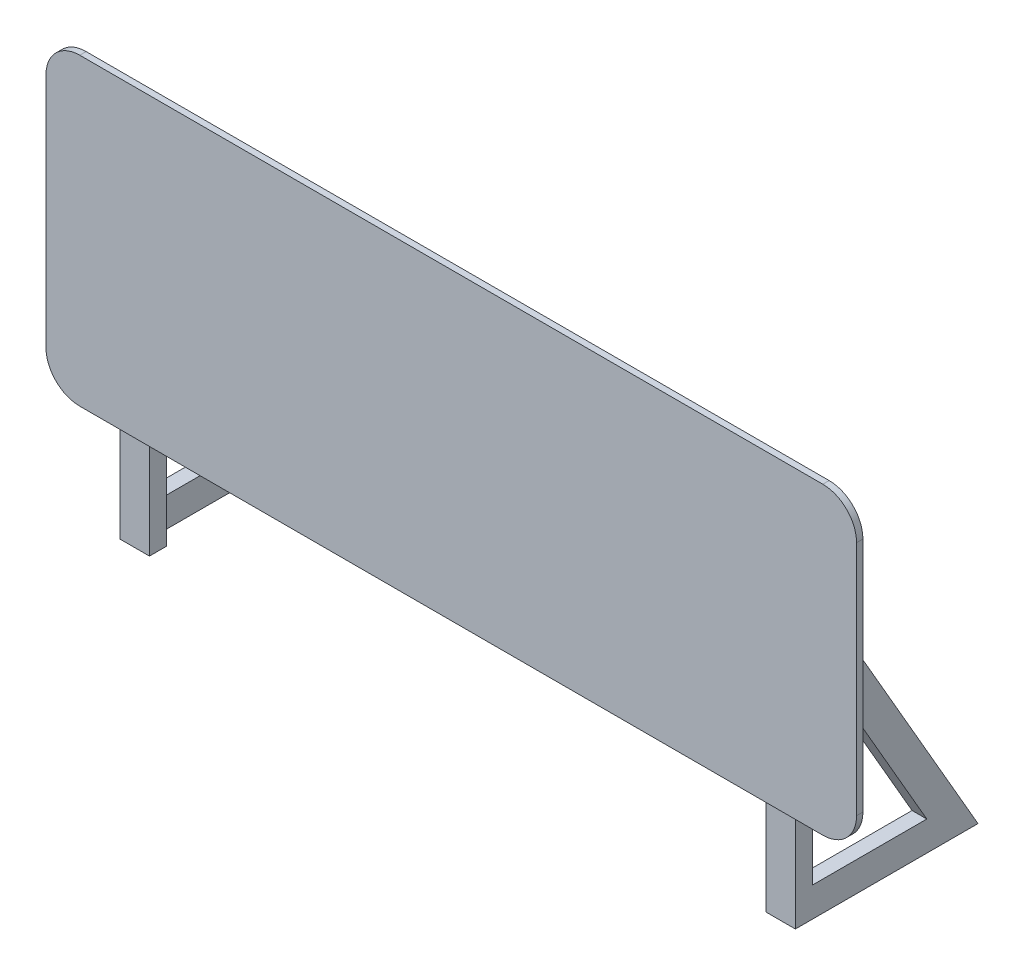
ISO-10303-21;
HEADER;
FILE_DESCRIPTION(('STEP AP214'),'2;1');
FILE_NAME('part.step','',(''),(''),'','','');
FILE_SCHEMA(('AUTOMOTIVE_DESIGN { 1 0 10303 214 1 1 1 1 }'));
ENDSEC;
DATA;
#1=APPLICATION_CONTEXT('core data for automotive mechanical design processes');
#2=APPLICATION_PROTOCOL_DEFINITION('international standard','automotive_design',2000,#1);
#3=PRODUCT_CONTEXT('',#1,'mechanical');
#4=PRODUCT('Part','Part','',(#3));
#5=PRODUCT_RELATED_PRODUCT_CATEGORY('part','',(#4));
#6=PRODUCT_DEFINITION_FORMATION('','',#4);
#7=PRODUCT_DEFINITION_CONTEXT('part definition',#1,'design');
#8=PRODUCT_DEFINITION('design','',#6,#7);
#9=PRODUCT_DEFINITION_SHAPE('','',#8);
#10=(LENGTH_UNIT() NAMED_UNIT(*) SI_UNIT(.MILLI.,.METRE.));
#11=(NAMED_UNIT(*) PLANE_ANGLE_UNIT() SI_UNIT($,.RADIAN.));
#12=(NAMED_UNIT(*) SI_UNIT($,.STERADIAN.) SOLID_ANGLE_UNIT());
#13=UNCERTAINTY_MEASURE_WITH_UNIT(LENGTH_MEASURE(1.E-05),#10,'distance_accuracy_value','');
#14=(GEOMETRIC_REPRESENTATION_CONTEXT(3) GLOBAL_UNCERTAINTY_ASSIGNED_CONTEXT((#13)) GLOBAL_UNIT_ASSIGNED_CONTEXT((#10,
#11,#12)) REPRESENTATION_CONTEXT('',''));
#15=CARTESIAN_POINT('',(0.,0.,0.));
#16=DIRECTION('',(0.,0.,1.));
#17=DIRECTION('',(1.,0.,0.));
#18=AXIS2_PLACEMENT_3D('',#15,#16,#17);
#19=CARTESIAN_POINT('',(1016.,152.4,-50.8));
#20=DIRECTION('',(0.,0.,-1.));
#21=DIRECTION('',(-1.,0.,0.));
#22=AXIS2_PLACEMENT_3D('',#19,#20,#21);
#23=PLANE('',#22);
#24=DIRECTION('',(1.,0.,0.));
#25=VECTOR('',#24,1.);
#26=CARTESIAN_POINT('',(927.1,673.1,-50.8));
#27=LINE('',#26,#25);
#28=CARTESIAN_POINT('',(-927.1,673.1,-50.8));
#29=VERTEX_POINT('',#28);
#30=CARTESIAN_POINT('',(927.1,673.1,-50.8));
#31=VERTEX_POINT('',#30);
#32=EDGE_CURVE('E329',#29,#31,#27,.T.);
#33=ORIENTED_EDGE('',*,*,#32,.F.);
#34=DIRECTION('',(0.,1.,0.));
#35=VECTOR('',#34,1.);
#36=CARTESIAN_POINT('',(-927.1,673.1,-50.8));
#37=LINE('',#36,#35);
#38=CARTESIAN_POINT('',(-927.1,241.3,-50.8));
#39=VERTEX_POINT('',#38);
#40=EDGE_CURVE('E327',#39,#29,#37,.T.);
#41=ORIENTED_EDGE('',*,*,#40,.F.);
#42=DIRECTION('',(-1.,0.,0.));
#43=VECTOR('',#42,1.);
#44=CARTESIAN_POINT('',(927.1,241.3,-50.8));
#45=LINE('',#44,#43);
#46=CARTESIAN_POINT('',(927.1,241.3,-50.8));
#47=VERTEX_POINT('',#46);
#48=EDGE_CURVE('E335',#47,#39,#45,.T.);
#49=ORIENTED_EDGE('',*,*,#48,.F.);
#50=DIRECTION('',(0.,-1.,0.));
#51=VECTOR('',#50,1.);
#52=CARTESIAN_POINT('',(927.1,673.1,-50.8));
#53=LINE('',#52,#51);
#54=EDGE_CURVE('E332',#31,#47,#53,.T.);
#55=ORIENTED_EDGE('',*,*,#54,.F.);
#56=EDGE_LOOP('',(#33,#41,#49,#55));
#57=FACE_BOUND('',#56,.T.);
#58=DIRECTION('',(0.,-1.,0.));
#59=VECTOR('',#58,1.);
#60=CARTESIAN_POINT('',(1016.,762.,-50.8));
#61=LINE('',#60,#59);
#62=CARTESIAN_POINT('',(1016.,381.000000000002,-50.8));
#63=VERTEX_POINT('',#62);
#64=CARTESIAN_POINT('',(1016.,-215.9,-50.8));
#65=VERTEX_POINT('',#64);
#66=EDGE_CURVE('E360',#63,#65,#61,.T.);
#67=ORIENTED_EDGE('',*,*,#66,.T.);
#68=DIRECTION('',(1.,0.,0.));
#69=VECTOR('',#68,1.);
#70=CARTESIAN_POINT('',(971.55,-215.9,-50.8));
#71=LINE('',#70,#69);
#72=CARTESIAN_POINT('',(971.55,-215.9,-50.8));
#73=VERTEX_POINT('',#72);
#74=EDGE_CURVE('E49',#73,#65,#71,.T.);
#75=ORIENTED_EDGE('',*,*,#74,.F.);
#76=DIRECTION('',(0.,1.,0.));
#77=VECTOR('',#76,1.);
#78=CARTESIAN_POINT('',(971.55,-304.8,-50.8));
#79=LINE('',#78,#77);
#80=CARTESIAN_POINT('',(971.55,-304.8,-50.8));
#81=VERTEX_POINT('',#80);
#82=EDGE_CURVE('E251',#81,#73,#79,.T.);
#83=ORIENTED_EDGE('',*,*,#82,.F.);
#84=DIRECTION('',(-1.,0.,0.));
#85=VECTOR('',#84,1.);
#86=CARTESIAN_POINT('',(1016.,-304.8,-50.8));
#87=LINE('',#86,#85);
#88=CARTESIAN_POINT('',(927.1,-304.8,-50.8));
#89=VERTEX_POINT('',#88);
#90=EDGE_CURVE('E359',#81,#89,#87,.T.);
#91=ORIENTED_EDGE('',*,*,#90,.T.);
#92=DIRECTION('',(0.,1.,0.));
#93=VECTOR('',#92,1.);
#94=CARTESIAN_POINT('',(927.1,152.4,-50.8));
#95=LINE('',#94,#93);
#96=CARTESIAN_POINT('',(927.1,152.4,-50.8));
#97=VERTEX_POINT('',#96);
#98=EDGE_CURVE('E362',#89,#97,#95,.T.);
#99=ORIENTED_EDGE('',*,*,#98,.T.);
#100=DIRECTION('',(-1.,0.,0.));
#101=VECTOR('',#100,1.);
#102=CARTESIAN_POINT('',(927.1,152.4,-50.8));
#103=LINE('',#102,#101);
#104=CARTESIAN_POINT('',(-927.1,152.4,-50.8));
#105=VERTEX_POINT('',#104);
#106=EDGE_CURVE('E364',#97,#105,#103,.T.);
#107=ORIENTED_EDGE('',*,*,#106,.T.);
#108=DIRECTION('',(0.,-1.,0.));
#109=VECTOR('',#108,1.);
#110=CARTESIAN_POINT('',(-927.1,152.4,-50.8));
#111=LINE('',#110,#109);
#112=CARTESIAN_POINT('',(-927.1,-304.8,-50.8));
#113=VERTEX_POINT('',#112);
#114=EDGE_CURVE('E366',#105,#113,#111,.T.);
#115=ORIENTED_EDGE('',*,*,#114,.T.);
#116=DIRECTION('',(-1.,0.,0.));
#117=VECTOR('',#116,1.);
#118=CARTESIAN_POINT('',(-927.1,-304.8,-50.8));
#119=LINE('',#118,#117);
#120=CARTESIAN_POINT('',(-971.55,-304.8,-50.8));
#121=VERTEX_POINT('',#120);
#122=EDGE_CURVE('E368',#113,#121,#119,.T.);
#123=ORIENTED_EDGE('',*,*,#122,.T.);
#124=DIRECTION('',(0.,1.,0.));
#125=VECTOR('',#124,1.);
#126=CARTESIAN_POINT('',(-971.55,-304.8,-50.8));
#127=LINE('',#126,#125);
#128=CARTESIAN_POINT('',(-971.55,-215.9,-50.8));
#129=VERTEX_POINT('',#128);
#130=EDGE_CURVE('E297',#121,#129,#127,.T.);
#131=ORIENTED_EDGE('',*,*,#130,.T.);
#132=DIRECTION('',(-1.,0.,0.));
#133=VECTOR('',#132,1.);
#134=CARTESIAN_POINT('',(-971.55,-215.9,-50.8));
#135=LINE('',#134,#133);
#136=CARTESIAN_POINT('',(-1016.,-215.9,-50.8));
#137=VERTEX_POINT('',#136);
#138=EDGE_CURVE('E319',#129,#137,#135,.T.);
#139=ORIENTED_EDGE('',*,*,#138,.T.);
#140=DIRECTION('',(0.,1.,0.));
#141=VECTOR('',#140,1.);
#142=CARTESIAN_POINT('',(-1016.,762.,-50.8));
#143=LINE('',#142,#141);
#144=CARTESIAN_POINT('',(-1016.,381.000000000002,-50.8));
#145=VERTEX_POINT('',#144);
#146=EDGE_CURVE('E372',#137,#145,#143,.T.);
#147=ORIENTED_EDGE('',*,*,#146,.T.);
#148=DIRECTION('',(-1.,0.,0.));
#149=VECTOR('',#148,1.);
#150=CARTESIAN_POINT('',(-971.55,381.000000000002,-50.8));
#151=LINE('',#150,#149);
#152=CARTESIAN_POINT('',(-971.55,381.000000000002,-50.8));
#153=VERTEX_POINT('',#152);
#154=EDGE_CURVE('E313',#153,#145,#151,.T.);
#155=ORIENTED_EDGE('',*,*,#154,.F.);
#156=DIRECTION('',(0.,1.,0.));
#157=VECTOR('',#156,1.);
#158=CARTESIAN_POINT('',(-971.55,381.000000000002,-50.8));
#159=LINE('',#158,#157);
#160=CARTESIAN_POINT('',(-971.55,558.8,-50.8));
#161=VERTEX_POINT('',#160);
#162=EDGE_CURVE('E288',#153,#161,#159,.T.);
#163=ORIENTED_EDGE('',*,*,#162,.T.);
#164=DIRECTION('',(-1.,0.,0.));
#165=VECTOR('',#164,1.);
#166=CARTESIAN_POINT('',(-971.55,558.8,-50.8));
#167=LINE('',#166,#165);
#168=CARTESIAN_POINT('',(-1016.,558.8,-50.8));
#169=VERTEX_POINT('',#168);
#170=EDGE_CURVE('E305',#161,#169,#167,.T.);
#171=ORIENTED_EDGE('',*,*,#170,.T.);
#172=CARTESIAN_POINT('',(-1016.,762.,-50.8));
#173=VERTEX_POINT('',#172);
#174=EDGE_CURVE('E370',#169,#173,#143,.T.);
#175=ORIENTED_EDGE('',*,*,#174,.T.);
#176=DIRECTION('',(1.,0.,0.));
#177=VECTOR('',#176,1.);
#178=CARTESIAN_POINT('',(-1016.,762.,-50.8));
#179=LINE('',#178,#177);
#180=CARTESIAN_POINT('',(1016.,762.,-50.8));
#181=VERTEX_POINT('',#180);
#182=EDGE_CURVE('E373',#173,#181,#179,.T.);
#183=ORIENTED_EDGE('',*,*,#182,.T.);
#184=CARTESIAN_POINT('',(1016.,558.8,-50.8));
#185=VERTEX_POINT('',#184);
#186=EDGE_CURVE('E357',#181,#185,#61,.T.);
#187=ORIENTED_EDGE('',*,*,#186,.T.);
#188=DIRECTION('',(1.,0.,0.));
#189=VECTOR('',#188,1.);
#190=CARTESIAN_POINT('',(971.55,558.8,-50.8));
#191=LINE('',#190,#189);
#192=CARTESIAN_POINT('',(971.55,558.8,-50.8));
#193=VERTEX_POINT('',#192);
#194=EDGE_CURVE('E56',#193,#185,#191,.T.);
#195=ORIENTED_EDGE('',*,*,#194,.F.);
#196=DIRECTION('',(0.,1.,0.));
#197=VECTOR('',#196,1.);
#198=CARTESIAN_POINT('',(971.55,381.000000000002,-50.8));
#199=LINE('',#198,#197);
#200=CARTESIAN_POINT('',(971.55,381.000000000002,-50.8));
#201=VERTEX_POINT('',#200);
#202=EDGE_CURVE('E266',#201,#193,#199,.T.);
#203=ORIENTED_EDGE('',*,*,#202,.F.);
#204=DIRECTION('',(1.,0.,0.));
#205=VECTOR('',#204,1.);
#206=CARTESIAN_POINT('',(971.55,381.000000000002,-50.8));
#207=LINE('',#206,#205);
#208=EDGE_CURVE('E262',#201,#63,#207,.T.);
#209=ORIENTED_EDGE('',*,*,#208,.T.);
#210=EDGE_LOOP('',(#67,#75,#83,#91,#99,#107,#115,#123,#131,#139,#147,#155,#163,#171,#175,#183,
#187,#195,#203,#209));
#211=FACE_BOUND('',#210,.T.);
#212=ADVANCED_FACE('F31',(#57,#211),#23,.T.);
#213=CARTESIAN_POINT('',(1117.6,812.8,0.));
#214=DIRECTION('',(0.,0.,-1.));
#215=DIRECTION('',(-1.,0.,0.));
#216=AXIS2_PLACEMENT_3D('',#213,#214,#215);
#217=PLANE('',#216);
#218=DIRECTION('',(0.,-1.,0.));
#219=VECTOR('',#218,1.);
#220=CARTESIAN_POINT('',(1016.,762.,0.));
#221=LINE('',#220,#219);
#222=CARTESIAN_POINT('',(1016.,762.,0.));
#223=VERTEX_POINT('',#222);
#224=CARTESIAN_POINT('',(1016.,0.,0.));
#225=VERTEX_POINT('',#224);
#226=EDGE_CURVE('E376',#223,#225,#221,.T.);
#227=ORIENTED_EDGE('',*,*,#226,.F.);
#228=DIRECTION('',(1.,0.,0.));
#229=VECTOR('',#228,1.);
#230=CARTESIAN_POINT('',(1016.,762.,0.));
#231=LINE('',#230,#229);
#232=CARTESIAN_POINT('',(-1016.,762.,0.));
#233=VERTEX_POINT('',#232);
#234=EDGE_CURVE('E394',#233,#223,#231,.T.);
#235=ORIENTED_EDGE('',*,*,#234,.F.);
#236=DIRECTION('',(0.,1.,0.));
#237=VECTOR('',#236,1.);
#238=CARTESIAN_POINT('',(-1016.,762.,0.));
#239=LINE('',#238,#237);
#240=CARTESIAN_POINT('',(-1016.,0.,0.));
#241=VERTEX_POINT('',#240);
#242=EDGE_CURVE('E11',#241,#233,#239,.T.);
#243=ORIENTED_EDGE('',*,*,#242,.F.);
#244=DIRECTION('',(1.,0.,0.));
#245=VECTOR('',#244,1.);
#246=CARTESIAN_POINT('',(-1117.6,0.,0.));
#247=LINE('',#246,#245);
#248=CARTESIAN_POINT('',(-1117.6,0.,0.));
#249=VERTEX_POINT('',#248);
#250=EDGE_CURVE('E451',#249,#241,#247,.T.);
#251=ORIENTED_EDGE('',*,*,#250,.F.);
#252=CARTESIAN_POINT('',(-1117.6,101.6,0.));
#253=DIRECTION('',(0.,0.,1.));
#254=DIRECTION('',(1.,0.,0.));
#255=AXIS2_PLACEMENT_3D('',#252,#253,#254);
#256=CIRCLE('',#255,101.6);
#257=CARTESIAN_POINT('',(-1219.2,101.6,0.));
#258=VERTEX_POINT('',#257);
#259=EDGE_CURVE('E448',#258,#249,#256,.T.);
#260=ORIENTED_EDGE('',*,*,#259,.F.);
#261=DIRECTION('',(0.,-1.,0.));
#262=VECTOR('',#261,1.);
#263=CARTESIAN_POINT('',(-1219.2,812.8,0.));
#264=LINE('',#263,#262);
#265=CARTESIAN_POINT('',(-1219.2,812.8,0.));
#266=VERTEX_POINT('',#265);
#267=EDGE_CURVE('E446',#266,#258,#264,.T.);
#268=ORIENTED_EDGE('',*,*,#267,.F.);
#269=CARTESIAN_POINT('',(-1117.6,812.8,0.));
#270=DIRECTION('',(0.,0.,1.));
#271=DIRECTION('',(1.,0.,0.));
#272=AXIS2_PLACEMENT_3D('',#269,#270,#271);
#273=CIRCLE('',#272,101.6);
#274=CARTESIAN_POINT('',(-1117.6,914.4,0.));
#275=VERTEX_POINT('',#274);
#276=EDGE_CURVE('E444',#275,#266,#273,.T.);
#277=ORIENTED_EDGE('',*,*,#276,.F.);
#278=DIRECTION('',(-1.,0.,0.));
#279=VECTOR('',#278,1.);
#280=CARTESIAN_POINT('',(-1117.6,914.4,0.));
#281=LINE('',#280,#279);
#282=CARTESIAN_POINT('',(1117.6,914.4,0.));
#283=VERTEX_POINT('',#282);
#284=EDGE_CURVE('E442',#283,#275,#281,.T.);
#285=ORIENTED_EDGE('',*,*,#284,.F.);
#286=CARTESIAN_POINT('',(1117.6,812.8,0.));
#287=DIRECTION('',(0.,0.,1.));
#288=DIRECTION('',(-1.,0.,0.));
#289=AXIS2_PLACEMENT_3D('',#286,#287,#288);
#290=CIRCLE('',#289,101.6);
#291=CARTESIAN_POINT('',(1219.2,812.8,0.));
#292=VERTEX_POINT('',#291);
#293=EDGE_CURVE('E420',#292,#283,#290,.T.);
#294=ORIENTED_EDGE('',*,*,#293,.F.);
#295=DIRECTION('',(0.,1.,0.));
#296=VECTOR('',#295,1.);
#297=CARTESIAN_POINT('',(1219.2,812.8,0.));
#298=LINE('',#297,#296);
#299=CARTESIAN_POINT('',(1219.2,101.6,0.));
#300=VERTEX_POINT('',#299);
#301=EDGE_CURVE('E425',#300,#292,#298,.T.);
#302=ORIENTED_EDGE('',*,*,#301,.F.);
#303=CARTESIAN_POINT('',(1117.6,101.6,0.));
#304=DIRECTION('',(0.,0.,1.));
#305=DIRECTION('',(1.,0.,0.));
#306=AXIS2_PLACEMENT_3D('',#303,#304,#305);
#307=CIRCLE('',#306,101.6);
#308=CARTESIAN_POINT('',(1117.6,0.,0.));
#309=VERTEX_POINT('',#308);
#310=EDGE_CURVE('E454',#309,#300,#307,.T.);
#311=ORIENTED_EDGE('',*,*,#310,.F.);
#312=EDGE_CURVE('E450',#225,#309,#247,.T.);
#313=ORIENTED_EDGE('',*,*,#312,.F.);
#314=EDGE_LOOP('',(#227,#235,#243,#251,#260,#268,#277,#285,#294,#302,#311,#313));
#315=FACE_BOUND('',#314,.T.);
#316=ADVANCED_FACE('F518',(#315),#217,.T.);
#317=CARTESIAN_POINT('',(1117.6,812.8,19.05));
#318=DIRECTION('',(0.,0.,-1.));
#319=DIRECTION('',(-1.,0.,0.));
#320=AXIS2_PLACEMENT_3D('',#317,#318,#319);
#321=CYLINDRICAL_SURFACE('',#320,101.6);
#322=ORIENTED_EDGE('',*,*,#293,.T.);
#323=DIRECTION('',(0.,0.,-1.));
#324=VECTOR('',#323,1.);
#325=CARTESIAN_POINT('',(1117.6,914.4,19.05));
#326=LINE('',#325,#324);
#327=CARTESIAN_POINT('',(1117.6,914.4,19.05));
#328=VERTEX_POINT('',#327);
#329=EDGE_CURVE('E35',#328,#283,#326,.T.);
#330=ORIENTED_EDGE('',*,*,#329,.F.);
#331=CARTESIAN_POINT('',(1117.6,812.8,19.05));
#332=DIRECTION('',(0.,0.,1.));
#333=DIRECTION('',(-1.,0.,0.));
#334=AXIS2_PLACEMENT_3D('',#331,#332,#333);
#335=CIRCLE('',#334,101.6);
#336=CARTESIAN_POINT('',(1219.2,812.8,19.05));
#337=VERTEX_POINT('',#336);
#338=EDGE_CURVE('E421',#337,#328,#335,.T.);
#339=ORIENTED_EDGE('',*,*,#338,.F.);
#340=DIRECTION('',(0.,0.,-1.));
#341=VECTOR('',#340,1.);
#342=CARTESIAN_POINT('',(1219.2,812.8,19.05));
#343=LINE('',#342,#341);
#344=EDGE_CURVE('E439',#337,#292,#343,.T.);
#345=ORIENTED_EDGE('',*,*,#344,.T.);
#346=EDGE_LOOP('',(#322,#330,#339,#345));
#347=FACE_BOUND('',#346,.T.);
#348=ADVANCED_FACE('F33',(#347),#321,.T.);
#349=CARTESIAN_POINT('',(-1117.6,914.4,19.05));
#350=DIRECTION('',(0.,-1.,0.));
#351=DIRECTION('',(0.,0.,-1.));
#352=AXIS2_PLACEMENT_3D('',#349,#350,#351);
#353=PLANE('',#352);
#354=ORIENTED_EDGE('',*,*,#284,.T.);
#355=DIRECTION('',(0.,0.,-1.));
#356=VECTOR('',#355,1.);
#357=CARTESIAN_POINT('',(-1117.6,914.4,19.05));
#358=LINE('',#357,#356);
#359=CARTESIAN_POINT('',(-1117.6,914.4,19.05));
#360=VERTEX_POINT('',#359);
#361=EDGE_CURVE('E474',#360,#275,#358,.T.);
#362=ORIENTED_EDGE('',*,*,#361,.F.);
#363=DIRECTION('',(-1.,0.,0.));
#364=VECTOR('',#363,1.);
#365=CARTESIAN_POINT('',(-1117.6,914.4,19.05));
#366=LINE('',#365,#364);
#367=EDGE_CURVE('E424',#328,#360,#366,.T.);
#368=ORIENTED_EDGE('',*,*,#367,.F.);
#369=ORIENTED_EDGE('',*,*,#329,.T.);
#370=EDGE_LOOP('',(#354,#362,#368,#369));
#371=FACE_BOUND('',#370,.T.);
#372=ADVANCED_FACE('F635',(#371),#353,.F.);
#373=CARTESIAN_POINT('',(-1117.6,812.8,19.05));
#374=DIRECTION('',(0.,0.,-1.));
#375=DIRECTION('',(-1.,0.,0.));
#376=AXIS2_PLACEMENT_3D('',#373,#374,#375);
#377=CYLINDRICAL_SURFACE('',#376,101.6);
#378=ORIENTED_EDGE('',*,*,#276,.T.);
#379=DIRECTION('',(0.,0.,-1.));
#380=VECTOR('',#379,1.);
#381=CARTESIAN_POINT('',(-1219.2,812.8,19.05));
#382=LINE('',#381,#380);
#383=CARTESIAN_POINT('',(-1219.2,812.8,19.05));
#384=VERTEX_POINT('',#383);
#385=EDGE_CURVE('E472',#384,#266,#382,.T.);
#386=ORIENTED_EDGE('',*,*,#385,.F.);
#387=CARTESIAN_POINT('',(-1117.6,812.8,19.05));
#388=DIRECTION('',(0.,0.,1.));
#389=DIRECTION('',(1.,0.,0.));
#390=AXIS2_PLACEMENT_3D('',#387,#388,#389);
#391=CIRCLE('',#390,101.6);
#392=EDGE_CURVE('E427',#360,#384,#391,.T.);
#393=ORIENTED_EDGE('',*,*,#392,.F.);
#394=ORIENTED_EDGE('',*,*,#361,.T.);
#395=EDGE_LOOP('',(#378,#386,#393,#394));
#396=FACE_BOUND('',#395,.T.);
#397=ADVANCED_FACE('F632',(#396),#377,.T.);
#398=CARTESIAN_POINT('',(-1219.2,812.8,19.05));
#399=DIRECTION('',(1.,0.,0.));
#400=DIRECTION('',(0.,1.,0.));
#401=AXIS2_PLACEMENT_3D('',#398,#399,#400);
#402=PLANE('',#401);
#403=ORIENTED_EDGE('',*,*,#267,.T.);
#404=DIRECTION('',(0.,0.,-1.));
#405=VECTOR('',#404,1.);
#406=CARTESIAN_POINT('',(-1219.2,101.6,19.05));
#407=LINE('',#406,#405);
#408=CARTESIAN_POINT('',(-1219.2,101.6,19.05));
#409=VERTEX_POINT('',#408);
#410=EDGE_CURVE('E469',#409,#258,#407,.T.);
#411=ORIENTED_EDGE('',*,*,#410,.F.);
#412=DIRECTION('',(0.,-1.,0.));
#413=VECTOR('',#412,1.);
#414=CARTESIAN_POINT('',(-1219.2,812.8,19.05));
#415=LINE('',#414,#413);
#416=EDGE_CURVE('E429',#384,#409,#415,.T.);
#417=ORIENTED_EDGE('',*,*,#416,.F.);
#418=ORIENTED_EDGE('',*,*,#385,.T.);
#419=EDGE_LOOP('',(#403,#411,#417,#418));
#420=FACE_BOUND('',#419,.T.);
#421=ADVANCED_FACE('F629',(#420),#402,.F.);
#422=CARTESIAN_POINT('',(-1117.6,101.6,19.05));
#423=DIRECTION('',(0.,0.,-1.));
#424=DIRECTION('',(-1.,0.,0.));
#425=AXIS2_PLACEMENT_3D('',#422,#423,#424);
#426=CYLINDRICAL_SURFACE('',#425,101.6);
#427=ORIENTED_EDGE('',*,*,#259,.T.);
#428=DIRECTION('',(0.,0.,-1.));
#429=VECTOR('',#428,1.);
#430=CARTESIAN_POINT('',(-1117.6,0.,19.05));
#431=LINE('',#430,#429);
#432=CARTESIAN_POINT('',(-1117.6,0.,19.05));
#433=VERTEX_POINT('',#432);
#434=EDGE_CURVE('E466',#433,#249,#431,.T.);
#435=ORIENTED_EDGE('',*,*,#434,.F.);
#436=CARTESIAN_POINT('',(-1117.6,101.6,19.05));
#437=DIRECTION('',(0.,0.,1.));
#438=DIRECTION('',(1.,0.,0.));
#439=AXIS2_PLACEMENT_3D('',#436,#437,#438);
#440=CIRCLE('',#439,101.6);
#441=EDGE_CURVE('E431',#409,#433,#440,.T.);
#442=ORIENTED_EDGE('',*,*,#441,.F.);
#443=ORIENTED_EDGE('',*,*,#410,.T.);
#444=EDGE_LOOP('',(#427,#435,#442,#443));
#445=FACE_BOUND('',#444,.T.);
#446=ADVANCED_FACE('F626',(#445),#426,.T.);
#447=CARTESIAN_POINT('',(-1117.6,0.,19.05));
#448=DIRECTION('',(0.,1.,0.));
#449=DIRECTION('',(0.,0.,1.));
#450=AXIS2_PLACEMENT_3D('',#447,#448,#449);
#451=PLANE('',#450);
#452=ORIENTED_EDGE('',*,*,#250,.T.);
#453=CARTESIAN_POINT('',(-927.1,0.,0.));
#454=VERTEX_POINT('',#453);
#455=EDGE_CURVE('E455',#241,#454,#247,.T.);
#456=ORIENTED_EDGE('',*,*,#455,.T.);
#457=CARTESIAN_POINT('',(927.1,0.,0.));
#458=VERTEX_POINT('',#457);
#459=EDGE_CURVE('E507',#454,#458,#247,.T.);
#460=ORIENTED_EDGE('',*,*,#459,.T.);
#461=EDGE_CURVE('E505',#458,#225,#247,.T.);
#462=ORIENTED_EDGE('',*,*,#461,.T.);
#463=ORIENTED_EDGE('',*,*,#312,.T.);
#464=DIRECTION('',(0.,0.,-1.));
#465=VECTOR('',#464,1.);
#466=CARTESIAN_POINT('',(1117.6,0.,19.05));
#467=LINE('',#466,#465);
#468=CARTESIAN_POINT('',(1117.6,0.,19.05));
#469=VERTEX_POINT('',#468);
#470=EDGE_CURVE('E463',#469,#309,#467,.T.);
#471=ORIENTED_EDGE('',*,*,#470,.F.);
#472=DIRECTION('',(1.,0.,0.));
#473=VECTOR('',#472,1.);
#474=CARTESIAN_POINT('',(-1117.6,0.,19.05));
#475=LINE('',#474,#473);
#476=EDGE_CURVE('E433',#433,#469,#475,.T.);
#477=ORIENTED_EDGE('',*,*,#476,.F.);
#478=ORIENTED_EDGE('',*,*,#434,.T.);
#479=EDGE_LOOP('',(#452,#456,#460,#462,#463,#471,#477,#478));
#480=FACE_BOUND('',#479,.T.);
#481=ADVANCED_FACE('F509',(#480),#451,.F.);
#482=CARTESIAN_POINT('',(1117.6,101.6,19.05));
#483=DIRECTION('',(0.,0.,-1.));
#484=DIRECTION('',(-1.,0.,0.));
#485=AXIS2_PLACEMENT_3D('',#482,#483,#484);
#486=CYLINDRICAL_SURFACE('',#485,101.6);
#487=ORIENTED_EDGE('',*,*,#310,.T.);
#488=DIRECTION('',(0.,0.,-1.));
#489=VECTOR('',#488,1.);
#490=CARTESIAN_POINT('',(1219.2,101.6,19.05));
#491=LINE('',#490,#489);
#492=CARTESIAN_POINT('',(1219.2,101.6,19.05));
#493=VERTEX_POINT('',#492);
#494=EDGE_CURVE('E460',#493,#300,#491,.T.);
#495=ORIENTED_EDGE('',*,*,#494,.F.);
#496=CARTESIAN_POINT('',(1117.6,101.6,19.05));
#497=DIRECTION('',(0.,0.,1.));
#498=DIRECTION('',(1.,0.,0.));
#499=AXIS2_PLACEMENT_3D('',#496,#497,#498);
#500=CIRCLE('',#499,101.6);
#501=EDGE_CURVE('E435',#469,#493,#500,.T.);
#502=ORIENTED_EDGE('',*,*,#501,.F.);
#503=ORIENTED_EDGE('',*,*,#470,.T.);
#504=EDGE_LOOP('',(#487,#495,#502,#503));
#505=FACE_BOUND('',#504,.T.);
#506=ADVANCED_FACE('F515',(#505),#486,.T.);
#507=CARTESIAN_POINT('',(1219.2,812.8,19.05));
#508=DIRECTION('',(-1.,0.,0.));
#509=DIRECTION('',(0.,-1.,0.));
#510=AXIS2_PLACEMENT_3D('',#507,#508,#509);
#511=PLANE('',#510);
#512=ORIENTED_EDGE('',*,*,#301,.T.);
#513=ORIENTED_EDGE('',*,*,#344,.F.);
#514=DIRECTION('',(0.,1.,0.));
#515=VECTOR('',#514,1.);
#516=CARTESIAN_POINT('',(1219.2,812.8,19.05));
#517=LINE('',#516,#515);
#518=EDGE_CURVE('E437',#493,#337,#517,.T.);
#519=ORIENTED_EDGE('',*,*,#518,.F.);
#520=ORIENTED_EDGE('',*,*,#494,.T.);
#521=EDGE_LOOP('',(#512,#513,#519,#520));
#522=FACE_BOUND('',#521,.T.);
#523=ADVANCED_FACE('F522',(#522),#511,.F.);
#524=CARTESIAN_POINT('',(1117.6,812.8,19.05));
#525=DIRECTION('',(0.,0.,-1.));
#526=DIRECTION('',(-1.,0.,0.));
#527=AXIS2_PLACEMENT_3D('',#524,#525,#526);
#528=PLANE('',#527);
#529=ORIENTED_EDGE('',*,*,#338,.T.);
#530=ORIENTED_EDGE('',*,*,#367,.T.);
#531=ORIENTED_EDGE('',*,*,#392,.T.);
#532=ORIENTED_EDGE('',*,*,#416,.T.);
#533=ORIENTED_EDGE('',*,*,#441,.T.);
#534=ORIENTED_EDGE('',*,*,#476,.T.);
#535=ORIENTED_EDGE('',*,*,#501,.T.);
#536=ORIENTED_EDGE('',*,*,#518,.T.);
#537=EDGE_LOOP('',(#529,#530,#531,#532,#533,#534,#535,#536));
#538=FACE_BOUND('',#537,.T.);
#539=ADVANCED_FACE('F527',(#538),#528,.F.);
#540=DIRECTION('',(0.,-1.,0.));
#541=VECTOR('',#540,1.);
#542=CARTESIAN_POINT('',(-927.1,152.4,0.));
#543=LINE('',#542,#541);
#544=CARTESIAN_POINT('',(-927.1,152.4,0.));
#545=VERTEX_POINT('',#544);
#546=EDGE_CURVE('E388',#545,#454,#543,.T.);
#547=ORIENTED_EDGE('',*,*,#546,.F.);
#548=DIRECTION('',(-1.,0.,0.));
#549=VECTOR('',#548,1.);
#550=CARTESIAN_POINT('',(927.1,152.4,0.));
#551=LINE('',#550,#549);
#552=CARTESIAN_POINT('',(927.1,152.4,0.));
#553=VERTEX_POINT('',#552);
#554=EDGE_CURVE('E384',#553,#545,#551,.T.);
#555=ORIENTED_EDGE('',*,*,#554,.F.);
#556=DIRECTION('',(0.,1.,0.));
#557=VECTOR('',#556,1.);
#558=CARTESIAN_POINT('',(927.1,152.4,0.));
#559=LINE('',#558,#557);
#560=EDGE_CURVE('E40',#458,#553,#559,.T.);
#561=ORIENTED_EDGE('',*,*,#560,.F.);
#562=ORIENTED_EDGE('',*,*,#459,.F.);
#563=EDGE_LOOP('',(#547,#555,#561,#562));
#564=FACE_BOUND('',#563,.T.);
#565=ADVANCED_FACE('F580',(#564),#217,.T.);
#566=CARTESIAN_POINT('',(1016.,152.4,0.));
#567=DIRECTION('',(0.,0.,-1.));
#568=DIRECTION('',(-1.,0.,0.));
#569=AXIS2_PLACEMENT_3D('',#566,#567,#568);
#570=PLANE('',#569);
#571=ORIENTED_EDGE('',*,*,#455,.F.);
#572=CARTESIAN_POINT('',(-1016.,-304.8,0.));
#573=VERTEX_POINT('',#572);
#574=EDGE_CURVE('E42',#573,#241,#239,.T.);
#575=ORIENTED_EDGE('',*,*,#574,.F.);
#576=DIRECTION('',(-1.,0.,0.));
#577=VECTOR('',#576,1.);
#578=CARTESIAN_POINT('',(-927.1,-304.8,0.));
#579=LINE('',#578,#577);
#580=CARTESIAN_POINT('',(-927.1,-304.8,0.));
#581=VERTEX_POINT('',#580);
#582=EDGE_CURVE('E391',#581,#573,#579,.T.);
#583=ORIENTED_EDGE('',*,*,#582,.F.);
#584=EDGE_CURVE('E387',#454,#581,#543,.T.);
#585=ORIENTED_EDGE('',*,*,#584,.F.);
#586=EDGE_LOOP('',(#571,#575,#583,#585));
#587=FACE_BOUND('',#586,.T.);
#588=ADVANCED_FACE('F596',(#587),#570,.F.);
#589=ORIENTED_EDGE('',*,*,#461,.F.);
#590=CARTESIAN_POINT('',(927.1,-304.8,0.));
#591=VERTEX_POINT('',#590);
#592=EDGE_CURVE('E381',#591,#458,#559,.T.);
#593=ORIENTED_EDGE('',*,*,#592,.F.);
#594=DIRECTION('',(-1.,0.,0.));
#595=VECTOR('',#594,1.);
#596=CARTESIAN_POINT('',(1016.,-304.8,0.));
#597=LINE('',#596,#595);
#598=CARTESIAN_POINT('',(1016.,-304.8,0.));
#599=VERTEX_POINT('',#598);
#600=EDGE_CURVE('E379',#599,#591,#597,.T.);
#601=ORIENTED_EDGE('',*,*,#600,.F.);
#602=EDGE_CURVE('E356',#225,#599,#221,.T.);
#603=ORIENTED_EDGE('',*,*,#602,.F.);
#604=EDGE_LOOP('',(#589,#593,#601,#603));
#605=FACE_BOUND('',#604,.T.);
#606=ADVANCED_FACE('F502',(#605),#570,.F.);
#607=CARTESIAN_POINT('',(1016.,762.,-50.8));
#608=DIRECTION('',(-1.,0.,0.));
#609=DIRECTION('',(0.,-1.,0.));
#610=AXIS2_PLACEMENT_3D('',#607,#608,#609);
#611=PLANE('',#610);
#612=DIRECTION('',(0.,-0.866025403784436,-0.500000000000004));
#613=VECTOR('',#612,1.);
#614=CARTESIAN_POINT('',(1016.,558.8,-50.8));
#615=LINE('',#614,#613);
#616=CARTESIAN_POINT('',(1016.,-304.8,-549.399692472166));
#617=VERTEX_POINT('',#616);
#618=EDGE_CURVE('E268',#185,#617,#615,.T.);
#619=ORIENTED_EDGE('',*,*,#618,.F.);
#620=ORIENTED_EDGE('',*,*,#186,.F.);
#621=DIRECTION('',(0.,0.,1.));
#622=VECTOR('',#621,1.);
#623=CARTESIAN_POINT('',(1016.,762.,-50.8));
#624=LINE('',#623,#622);
#625=EDGE_CURVE('E375',#181,#223,#624,.T.);
#626=ORIENTED_EDGE('',*,*,#625,.T.);
#627=ORIENTED_EDGE('',*,*,#226,.T.);
#628=ORIENTED_EDGE('',*,*,#602,.T.);
#629=DIRECTION('',(0.,0.,1.));
#630=VECTOR('',#629,1.);
#631=CARTESIAN_POINT('',(1016.,-304.8,-50.8));
#632=LINE('',#631,#630);
#633=EDGE_CURVE('E417',#617,#599,#632,.T.);
#634=ORIENTED_EDGE('',*,*,#633,.F.);
#635=EDGE_LOOP('',(#619,#620,#626,#627,#628,#634));
#636=FACE_BOUND('',#635,.T.);
#637=ORIENTED_EDGE('',*,*,#66,.F.);
#638=DIRECTION('',(0.,0.866025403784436,0.500000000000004));
#639=VECTOR('',#638,1.);
#640=CARTESIAN_POINT('',(1016.,381.000000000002,-50.8));
#641=LINE('',#640,#639);
#642=CARTESIAN_POINT('',(1016.,-215.9,-395.420375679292));
#643=VERTEX_POINT('',#642);
#644=EDGE_CURVE('E276',#643,#63,#641,.T.);
#645=ORIENTED_EDGE('',*,*,#644,.F.);
#646=DIRECTION('',(0.,0.,-1.));
#647=VECTOR('',#646,1.);
#648=CARTESIAN_POINT('',(1016.,-215.9,-395.420375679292));
#649=LINE('',#648,#647);
#650=EDGE_CURVE('E258',#65,#643,#649,.T.);
#651=ORIENTED_EDGE('',*,*,#650,.F.);
#652=EDGE_LOOP('',(#637,#645,#651));
#653=FACE_BOUND('',#652,.T.);
#654=ADVANCED_FACE('F595',(#636,#653),#611,.F.);
#655=CARTESIAN_POINT('',(1016.,-304.8,-50.8));
#656=DIRECTION('',(0.,1.,0.));
#657=DIRECTION('',(-1.,0.,0.));
#658=AXIS2_PLACEMENT_3D('',#655,#656,#657);
#659=PLANE('',#658);
#660=ORIENTED_EDGE('',*,*,#600,.T.);
#661=DIRECTION('',(0.,0.,1.));
#662=VECTOR('',#661,1.);
#663=CARTESIAN_POINT('',(927.1,-304.8,-50.8));
#664=LINE('',#663,#662);
#665=EDGE_CURVE('E414',#89,#591,#664,.T.);
#666=ORIENTED_EDGE('',*,*,#665,.F.);
#667=ORIENTED_EDGE('',*,*,#90,.F.);
#668=DIRECTION('',(0.,0.,1.));
#669=VECTOR('',#668,1.);
#670=CARTESIAN_POINT('',(971.55,-304.8,-549.399692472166));
#671=LINE('',#670,#669);
#672=CARTESIAN_POINT('',(971.55,-304.8,-549.399692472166));
#673=VERTEX_POINT('',#672);
#674=EDGE_CURVE('E272',#673,#81,#671,.T.);
#675=ORIENTED_EDGE('',*,*,#674,.F.);
#676=DIRECTION('',(1.,0.,0.));
#677=VECTOR('',#676,1.);
#678=CARTESIAN_POINT('',(971.55,-304.8,-549.399692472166));
#679=LINE('',#678,#677);
#680=EDGE_CURVE('E283',#673,#617,#679,.T.);
#681=ORIENTED_EDGE('',*,*,#680,.T.);
#682=ORIENTED_EDGE('',*,*,#633,.T.);
#683=EDGE_LOOP('',(#660,#666,#667,#675,#681,#682));
#684=FACE_BOUND('',#683,.T.);
#685=ADVANCED_FACE('F611',(#684),#659,.F.);
#686=CARTESIAN_POINT('',(927.1,152.4,-50.8));
#687=DIRECTION('',(1.,0.,0.));
#688=DIRECTION('',(0.,0.,-1.));
#689=AXIS2_PLACEMENT_3D('',#686,#687,#688);
#690=PLANE('',#689);
#691=ORIENTED_EDGE('',*,*,#592,.T.);
#692=ORIENTED_EDGE('',*,*,#560,.T.);
#693=DIRECTION('',(0.,0.,1.));
#694=VECTOR('',#693,1.);
#695=CARTESIAN_POINT('',(927.1,152.4,-50.8));
#696=LINE('',#695,#694);
#697=EDGE_CURVE('E411',#97,#553,#696,.T.);
#698=ORIENTED_EDGE('',*,*,#697,.F.);
#699=ORIENTED_EDGE('',*,*,#98,.F.);
#700=ORIENTED_EDGE('',*,*,#665,.T.);
#701=EDGE_LOOP('',(#691,#692,#698,#699,#700));
#702=FACE_BOUND('',#701,.T.);
#703=ADVANCED_FACE('F486',(#702),#690,.F.);
#704=CARTESIAN_POINT('',(927.1,152.4,-50.8));
#705=DIRECTION('',(0.,1.,0.));
#706=DIRECTION('',(0.,0.,1.));
#707=AXIS2_PLACEMENT_3D('',#704,#705,#706);
#708=PLANE('',#707);
#709=ORIENTED_EDGE('',*,*,#554,.T.);
#710=DIRECTION('',(0.,0.,1.));
#711=VECTOR('',#710,1.);
#712=CARTESIAN_POINT('',(-927.1,152.4,-50.8));
#713=LINE('',#712,#711);
#714=EDGE_CURVE('E408',#105,#545,#713,.T.);
#715=ORIENTED_EDGE('',*,*,#714,.F.);
#716=ORIENTED_EDGE('',*,*,#106,.F.);
#717=ORIENTED_EDGE('',*,*,#697,.T.);
#718=EDGE_LOOP('',(#709,#715,#716,#717));
#719=FACE_BOUND('',#718,.T.);
#720=ADVANCED_FACE('F493',(#719),#708,.F.);
#721=CARTESIAN_POINT('',(-927.1,152.4,-50.8));
#722=DIRECTION('',(-1.,0.,0.));
#723=DIRECTION('',(0.,-1.,0.));
#724=AXIS2_PLACEMENT_3D('',#721,#722,#723);
#725=PLANE('',#724);
#726=ORIENTED_EDGE('',*,*,#546,.T.);
#727=ORIENTED_EDGE('',*,*,#584,.T.);
#728=DIRECTION('',(0.,0.,1.));
#729=VECTOR('',#728,1.);
#730=CARTESIAN_POINT('',(-927.1,-304.8,-50.8));
#731=LINE('',#730,#729);
#732=EDGE_CURVE('E405',#113,#581,#731,.T.);
#733=ORIENTED_EDGE('',*,*,#732,.F.);
#734=ORIENTED_EDGE('',*,*,#114,.F.);
#735=ORIENTED_EDGE('',*,*,#714,.T.);
#736=EDGE_LOOP('',(#726,#727,#733,#734,#735));
#737=FACE_BOUND('',#736,.T.);
#738=ADVANCED_FACE('F603',(#737),#725,.F.);
#739=CARTESIAN_POINT('',(-927.1,-304.8,-50.8));
#740=DIRECTION('',(0.,1.,0.));
#741=DIRECTION('',(-1.,0.,0.));
#742=AXIS2_PLACEMENT_3D('',#739,#740,#741);
#743=PLANE('',#742);
#744=ORIENTED_EDGE('',*,*,#582,.T.);
#745=DIRECTION('',(0.,0.,1.));
#746=VECTOR('',#745,1.);
#747=CARTESIAN_POINT('',(-1016.,-304.8,-50.8));
#748=LINE('',#747,#746);
#749=CARTESIAN_POINT('',(-1016.,-304.8,-549.399692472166));
#750=VERTEX_POINT('',#749);
#751=EDGE_CURVE('E402',#750,#573,#748,.T.);
#752=ORIENTED_EDGE('',*,*,#751,.F.);
#753=DIRECTION('',(-1.,0.,0.));
#754=VECTOR('',#753,1.);
#755=CARTESIAN_POINT('',(-971.55,-304.8,-549.399692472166));
#756=LINE('',#755,#754);
#757=CARTESIAN_POINT('',(-971.55,-304.8,-549.399692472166));
#758=VERTEX_POINT('',#757);
#759=EDGE_CURVE('E322',#758,#750,#756,.T.);
#760=ORIENTED_EDGE('',*,*,#759,.F.);
#761=DIRECTION('',(0.,0.,1.));
#762=VECTOR('',#761,1.);
#763=CARTESIAN_POINT('',(-971.55,-304.8,-549.399692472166));
#764=LINE('',#763,#762);
#765=EDGE_CURVE('E294',#758,#121,#764,.T.);
#766=ORIENTED_EDGE('',*,*,#765,.T.);
#767=ORIENTED_EDGE('',*,*,#122,.F.);
#768=ORIENTED_EDGE('',*,*,#732,.T.);
#769=EDGE_LOOP('',(#744,#752,#760,#766,#767,#768));
#770=FACE_BOUND('',#769,.T.);
#771=ADVANCED_FACE('F554',(#770),#743,.F.);
#772=CARTESIAN_POINT('',(-1016.,762.,-50.8));
#773=DIRECTION('',(1.,0.,0.));
#774=DIRECTION('',(0.,1.,0.));
#775=AXIS2_PLACEMENT_3D('',#772,#773,#774);
#776=PLANE('',#775);
#777=ORIENTED_EDGE('',*,*,#174,.F.);
#778=DIRECTION('',(0.,-0.866025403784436,-0.500000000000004));
#779=VECTOR('',#778,1.);
#780=CARTESIAN_POINT('',(-1016.,558.8,-50.8));
#781=LINE('',#780,#779);
#782=EDGE_CURVE('E282',#169,#750,#781,.T.);
#783=ORIENTED_EDGE('',*,*,#782,.T.);
#784=ORIENTED_EDGE('',*,*,#751,.T.);
#785=ORIENTED_EDGE('',*,*,#574,.T.);
#786=ORIENTED_EDGE('',*,*,#242,.T.);
#787=DIRECTION('',(0.,0.,1.));
#788=VECTOR('',#787,1.);
#789=CARTESIAN_POINT('',(-1016.,762.,-50.8));
#790=LINE('',#789,#788);
#791=EDGE_CURVE('E399',#173,#233,#790,.T.);
#792=ORIENTED_EDGE('',*,*,#791,.F.);
#793=EDGE_LOOP('',(#777,#783,#784,#785,#786,#792));
#794=FACE_BOUND('',#793,.T.);
#795=DIRECTION('',(0.,0.866025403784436,0.500000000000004));
#796=VECTOR('',#795,1.);
#797=CARTESIAN_POINT('',(-1016.,381.000000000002,-50.8));
#798=LINE('',#797,#796);
#799=CARTESIAN_POINT('',(-1016.,-215.9,-395.420375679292));
#800=VERTEX_POINT('',#799);
#801=EDGE_CURVE('E291',#800,#145,#798,.T.);
#802=ORIENTED_EDGE('',*,*,#801,.T.);
#803=ORIENTED_EDGE('',*,*,#146,.F.);
#804=DIRECTION('',(0.,0.,-1.));
#805=VECTOR('',#804,1.);
#806=CARTESIAN_POINT('',(-1016.,-215.9,-395.420375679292));
#807=LINE('',#806,#805);
#808=EDGE_CURVE('E308',#137,#800,#807,.T.);
#809=ORIENTED_EDGE('',*,*,#808,.T.);
#810=EDGE_LOOP('',(#802,#803,#809));
#811=FACE_BOUND('',#810,.T.);
#812=ADVANCED_FACE('F538',(#794,#811),#776,.F.);
#813=CARTESIAN_POINT('',(1016.,762.,-50.8));
#814=DIRECTION('',(0.,-1.,0.));
#815=DIRECTION('',(0.,0.,-1.));
#816=AXIS2_PLACEMENT_3D('',#813,#814,#815);
#817=PLANE('',#816);
#818=ORIENTED_EDGE('',*,*,#234,.T.);
#819=ORIENTED_EDGE('',*,*,#625,.F.);
#820=ORIENTED_EDGE('',*,*,#182,.F.);
#821=ORIENTED_EDGE('',*,*,#791,.T.);
#822=EDGE_LOOP('',(#818,#819,#820,#821));
#823=FACE_BOUND('',#822,.T.);
#824=ADVANCED_FACE('F543',(#823),#817,.F.);
#825=CARTESIAN_POINT('',(-927.1,673.1,-50.8));
#826=DIRECTION('',(1.,0.,0.));
#827=DIRECTION('',(0.,1.,0.));
#828=AXIS2_PLACEMENT_3D('',#825,#826,#827);
#829=PLANE('',#828);
#830=DIRECTION('',(0.,1.,0.));
#831=VECTOR('',#830,1.);
#832=CARTESIAN_POINT('',(-927.1,673.1,0.));
#833=LINE('',#832,#831);
#834=CARTESIAN_POINT('',(-927.1,241.3,0.));
#835=VERTEX_POINT('',#834);
#836=CARTESIAN_POINT('',(-927.1,673.1,0.));
#837=VERTEX_POINT('',#836);
#838=EDGE_CURVE('E316',#835,#837,#833,.T.);
#839=ORIENTED_EDGE('',*,*,#838,.F.);
#840=DIRECTION('',(0.,0.,1.));
#841=VECTOR('',#840,1.);
#842=CARTESIAN_POINT('',(-927.1,241.3,-50.8));
#843=LINE('',#842,#841);
#844=EDGE_CURVE('E337',#39,#835,#843,.T.);
#845=ORIENTED_EDGE('',*,*,#844,.F.);
#846=ORIENTED_EDGE('',*,*,#40,.T.);
#847=DIRECTION('',(0.,0.,1.));
#848=VECTOR('',#847,1.);
#849=CARTESIAN_POINT('',(-927.1,673.1,-50.8));
#850=LINE('',#849,#848);
#851=EDGE_CURVE('E353',#29,#837,#850,.T.);
#852=ORIENTED_EDGE('',*,*,#851,.T.);
#853=EDGE_LOOP('',(#839,#845,#846,#852));
#854=FACE_BOUND('',#853,.T.);
#855=ADVANCED_FACE('F591',(#854),#829,.T.);
#856=CARTESIAN_POINT('',(927.1,673.1,-50.8));
#857=DIRECTION('',(0.,-1.,0.));
#858=DIRECTION('',(0.,0.,-1.));
#859=AXIS2_PLACEMENT_3D('',#856,#857,#858);
#860=PLANE('',#859);
#861=DIRECTION('',(1.,0.,0.));
#862=VECTOR('',#861,1.);
#863=CARTESIAN_POINT('',(927.1,673.1,0.));
#864=LINE('',#863,#862);
#865=CARTESIAN_POINT('',(927.1,673.1,0.));
#866=VERTEX_POINT('',#865);
#867=EDGE_CURVE('E340',#837,#866,#864,.T.);
#868=ORIENTED_EDGE('',*,*,#867,.F.);
#869=ORIENTED_EDGE('',*,*,#851,.F.);
#870=ORIENTED_EDGE('',*,*,#32,.T.);
#871=DIRECTION('',(0.,0.,1.));
#872=VECTOR('',#871,1.);
#873=CARTESIAN_POINT('',(927.1,673.1,-50.8));
#874=LINE('',#873,#872);
#875=EDGE_CURVE('E351',#31,#866,#874,.T.);
#876=ORIENTED_EDGE('',*,*,#875,.T.);
#877=EDGE_LOOP('',(#868,#869,#870,#876));
#878=FACE_BOUND('',#877,.T.);
#879=ADVANCED_FACE('F719',(#878),#860,.T.);
#880=CARTESIAN_POINT('',(927.1,673.1,-50.8));
#881=DIRECTION('',(-1.,0.,0.));
#882=DIRECTION('',(0.,0.,1.));
#883=AXIS2_PLACEMENT_3D('',#880,#881,#882);
#884=PLANE('',#883);
#885=DIRECTION('',(0.,-1.,0.));
#886=VECTOR('',#885,1.);
#887=CARTESIAN_POINT('',(927.1,673.1,0.));
#888=LINE('',#887,#886);
#889=CARTESIAN_POINT('',(927.1,241.3,0.));
#890=VERTEX_POINT('',#889);
#891=EDGE_CURVE('E343',#866,#890,#888,.T.);
#892=ORIENTED_EDGE('',*,*,#891,.F.);
#893=ORIENTED_EDGE('',*,*,#875,.F.);
#894=ORIENTED_EDGE('',*,*,#54,.T.);
#895=DIRECTION('',(0.,0.,1.));
#896=VECTOR('',#895,1.);
#897=CARTESIAN_POINT('',(927.1,241.3,-50.8));
#898=LINE('',#897,#896);
#899=EDGE_CURVE('E349',#47,#890,#898,.T.);
#900=ORIENTED_EDGE('',*,*,#899,.T.);
#901=EDGE_LOOP('',(#892,#893,#894,#900));
#902=FACE_BOUND('',#901,.T.);
#903=ADVANCED_FACE('F728',(#902),#884,.T.);
#904=CARTESIAN_POINT('',(927.1,241.3,-50.8));
#905=DIRECTION('',(0.,1.,0.));
#906=DIRECTION('',(0.,0.,1.));
#907=AXIS2_PLACEMENT_3D('',#904,#905,#906);
#908=PLANE('',#907);
#909=DIRECTION('',(-1.,0.,0.));
#910=VECTOR('',#909,1.);
#911=CARTESIAN_POINT('',(927.1,241.3,0.));
#912=LINE('',#911,#910);
#913=EDGE_CURVE('E330',#890,#835,#912,.T.);
#914=ORIENTED_EDGE('',*,*,#913,.F.);
#915=ORIENTED_EDGE('',*,*,#899,.F.);
#916=ORIENTED_EDGE('',*,*,#48,.T.);
#917=ORIENTED_EDGE('',*,*,#844,.T.);
#918=EDGE_LOOP('',(#914,#915,#916,#917));
#919=FACE_BOUND('',#918,.T.);
#920=ADVANCED_FACE('F577',(#919),#908,.T.);
#921=ORIENTED_EDGE('',*,*,#913,.T.);
#922=ORIENTED_EDGE('',*,*,#838,.T.);
#923=ORIENTED_EDGE('',*,*,#867,.T.);
#924=ORIENTED_EDGE('',*,*,#891,.T.);
#925=EDGE_LOOP('',(#921,#922,#923,#924));
#926=FACE_BOUND('',#925,.T.);
#927=ADVANCED_FACE('F570',(#926),#217,.T.);
#928=CARTESIAN_POINT('',(-971.55,381.000000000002,-50.8));
#929=DIRECTION('',(0.,-0.500000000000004,0.866025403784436));
#930=DIRECTION('',(0.,-0.866025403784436,-0.500000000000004));
#931=AXIS2_PLACEMENT_3D('',#928,#929,#930);
#932=PLANE('',#931);
#933=ORIENTED_EDGE('',*,*,#801,.F.);
#934=DIRECTION('',(-1.,0.,0.));
#935=VECTOR('',#934,1.);
#936=CARTESIAN_POINT('',(-971.55,-215.9,-395.420375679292));
#937=LINE('',#936,#935);
#938=CARTESIAN_POINT('',(-971.55,-215.9,-395.420375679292));
#939=VERTEX_POINT('',#938);
#940=EDGE_CURVE('E317',#939,#800,#937,.T.);
#941=ORIENTED_EDGE('',*,*,#940,.F.);
#942=DIRECTION('',(0.,0.866025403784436,0.500000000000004));
#943=VECTOR('',#942,1.);
#944=CARTESIAN_POINT('',(-971.55,381.000000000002,-50.8));
#945=LINE('',#944,#943);
#946=EDGE_CURVE('E302',#939,#153,#945,.T.);
#947=ORIENTED_EDGE('',*,*,#946,.T.);
#948=ORIENTED_EDGE('',*,*,#154,.T.);
#949=EDGE_LOOP('',(#933,#941,#947,#948));
#950=FACE_BOUND('',#949,.T.);
#951=ADVANCED_FACE('F568',(#950),#932,.T.);
#952=CARTESIAN_POINT('',(-971.55,-215.9,-395.420375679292));
#953=DIRECTION('',(0.,1.,0.));
#954=DIRECTION('',(-1.,0.,0.));
#955=AXIS2_PLACEMENT_3D('',#952,#953,#954);
#956=PLANE('',#955);
#957=ORIENTED_EDGE('',*,*,#808,.F.);
#958=ORIENTED_EDGE('',*,*,#138,.F.);
#959=DIRECTION('',(0.,0.,-1.));
#960=VECTOR('',#959,1.);
#961=CARTESIAN_POINT('',(-971.55,-215.9,-395.420375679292));
#962=LINE('',#961,#960);
#963=EDGE_CURVE('E299',#129,#939,#962,.T.);
#964=ORIENTED_EDGE('',*,*,#963,.T.);
#965=ORIENTED_EDGE('',*,*,#940,.T.);
#966=EDGE_LOOP('',(#957,#958,#964,#965));
#967=FACE_BOUND('',#966,.T.);
#968=ADVANCED_FACE('F565',(#967),#956,.T.);
#969=CARTESIAN_POINT('',(-971.55,558.8,-50.8));
#970=DIRECTION('',(0.,0.500000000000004,-0.866025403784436));
#971=DIRECTION('',(0.,0.866025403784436,0.500000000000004));
#972=AXIS2_PLACEMENT_3D('',#969,#970,#971);
#973=PLANE('',#972);
#974=ORIENTED_EDGE('',*,*,#782,.F.);
#975=ORIENTED_EDGE('',*,*,#170,.F.);
#976=DIRECTION('',(0.,-0.866025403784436,-0.500000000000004));
#977=VECTOR('',#976,1.);
#978=CARTESIAN_POINT('',(-971.55,558.8,-50.8));
#979=LINE('',#978,#977);
#980=EDGE_CURVE('E290',#161,#758,#979,.T.);
#981=ORIENTED_EDGE('',*,*,#980,.T.);
#982=ORIENTED_EDGE('',*,*,#759,.T.);
#983=EDGE_LOOP('',(#974,#975,#981,#982));
#984=FACE_BOUND('',#983,.T.);
#985=ADVANCED_FACE('F550',(#984),#973,.T.);
#986=CARTESIAN_POINT('',(-971.55,-304.8,-50.8));
#987=DIRECTION('',(1.,0.,0.));
#988=DIRECTION('',(0.,0.,-1.));
#989=AXIS2_PLACEMENT_3D('',#986,#987,#988);
#990=PLANE('',#989);
#991=ORIENTED_EDGE('',*,*,#162,.F.);
#992=ORIENTED_EDGE('',*,*,#946,.F.);
#993=ORIENTED_EDGE('',*,*,#963,.F.);
#994=ORIENTED_EDGE('',*,*,#130,.F.);
#995=ORIENTED_EDGE('',*,*,#765,.F.);
#996=ORIENTED_EDGE('',*,*,#980,.F.);
#997=EDGE_LOOP('',(#991,#992,#993,#994,#995,#996));
#998=FACE_BOUND('',#997,.T.);
#999=ADVANCED_FACE('F559',(#998),#990,.T.);
#1000=CARTESIAN_POINT('',(971.55,558.8,-50.8));
#1001=DIRECTION('',(0.,-0.500000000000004,0.866025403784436));
#1002=DIRECTION('',(0.,-0.866025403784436,-0.500000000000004));
#1003=AXIS2_PLACEMENT_3D('',#1000,#1001,#1002);
#1004=PLANE('',#1003);
#1005=ORIENTED_EDGE('',*,*,#618,.T.);
#1006=ORIENTED_EDGE('',*,*,#680,.F.);
#1007=DIRECTION('',(0.,-0.866025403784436,-0.500000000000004));
#1008=VECTOR('',#1007,1.);
#1009=CARTESIAN_POINT('',(971.55,558.8,-50.8));
#1010=LINE('',#1009,#1008);
#1011=EDGE_CURVE('E274',#193,#673,#1010,.T.);
#1012=ORIENTED_EDGE('',*,*,#1011,.F.);
#1013=ORIENTED_EDGE('',*,*,#194,.T.);
#1014=EDGE_LOOP('',(#1005,#1006,#1012,#1013));
#1015=FACE_BOUND('',#1014,.T.);
#1016=ADVANCED_FACE('F790',(#1015),#1004,.F.);
#1017=CARTESIAN_POINT('',(971.55,-215.9,-395.420375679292));
#1018=DIRECTION('',(0.,-1.,0.));
#1019=DIRECTION('',(1.,0.,0.));
#1020=AXIS2_PLACEMENT_3D('',#1017,#1018,#1019);
#1021=PLANE('',#1020);
#1022=ORIENTED_EDGE('',*,*,#650,.T.);
#1023=DIRECTION('',(1.,0.,0.));
#1024=VECTOR('',#1023,1.);
#1025=CARTESIAN_POINT('',(971.55,-215.9,-395.420375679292));
#1026=LINE('',#1025,#1024);
#1027=CARTESIAN_POINT('',(971.55,-215.9,-395.420375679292));
#1028=VERTEX_POINT('',#1027);
#1029=EDGE_CURVE('E255',#1028,#643,#1026,.T.);
#1030=ORIENTED_EDGE('',*,*,#1029,.F.);
#1031=DIRECTION('',(0.,0.,-1.));
#1032=VECTOR('',#1031,1.);
#1033=CARTESIAN_POINT('',(971.55,-215.9,-395.420375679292));
#1034=LINE('',#1033,#1032);
#1035=EDGE_CURVE('E243',#73,#1028,#1034,.T.);
#1036=ORIENTED_EDGE('',*,*,#1035,.F.);
#1037=ORIENTED_EDGE('',*,*,#74,.T.);
#1038=EDGE_LOOP('',(#1022,#1030,#1036,#1037));
#1039=FACE_BOUND('',#1038,.T.);
#1040=ADVANCED_FACE('F256',(#1039),#1021,.F.);
#1041=CARTESIAN_POINT('',(971.55,381.000000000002,-50.8));
#1042=DIRECTION('',(0.,0.500000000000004,-0.866025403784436));
#1043=DIRECTION('',(0.,0.866025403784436,0.500000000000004));
#1044=AXIS2_PLACEMENT_3D('',#1041,#1042,#1043);
#1045=PLANE('',#1044);
#1046=ORIENTED_EDGE('',*,*,#644,.T.);
#1047=ORIENTED_EDGE('',*,*,#208,.F.);
#1048=DIRECTION('',(0.,0.866025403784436,0.500000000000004));
#1049=VECTOR('',#1048,1.);
#1050=CARTESIAN_POINT('',(971.55,381.000000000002,-50.8));
#1051=LINE('',#1050,#1049);
#1052=EDGE_CURVE('E248',#1028,#201,#1051,.T.);
#1053=ORIENTED_EDGE('',*,*,#1052,.F.);
#1054=ORIENTED_EDGE('',*,*,#1029,.T.);
#1055=EDGE_LOOP('',(#1046,#1047,#1053,#1054));
#1056=FACE_BOUND('',#1055,.T.);
#1057=ADVANCED_FACE('F264',(#1056),#1045,.F.);
#1058=CARTESIAN_POINT('',(971.55,-304.8,-50.8));
#1059=DIRECTION('',(-1.,0.,0.));
#1060=DIRECTION('',(0.,0.,-1.));
#1061=AXIS2_PLACEMENT_3D('',#1058,#1059,#1060);
#1062=PLANE('',#1061);
#1063=ORIENTED_EDGE('',*,*,#202,.T.);
#1064=ORIENTED_EDGE('',*,*,#1011,.T.);
#1065=ORIENTED_EDGE('',*,*,#674,.T.);
#1066=ORIENTED_EDGE('',*,*,#82,.T.);
#1067=ORIENTED_EDGE('',*,*,#1035,.T.);
#1068=ORIENTED_EDGE('',*,*,#1052,.T.);
#1069=EDGE_LOOP('',(#1063,#1064,#1065,#1066,#1067,#1068));
#1070=FACE_BOUND('',#1069,.T.);
#1071=ADVANCED_FACE('F246',(#1070),#1062,.T.);
#1072=CLOSED_SHELL('',(#212,#316,#348,#372,#397,#421,#446,#481,#506,#523,#539,#565,#588,#606,
#654,#685,#703,#720,#738,#771,#812,#824,#855,#879,#903,#920,#927,#951,#968,#985,#999,#1016,
#1040,#1057,#1071));
#1073=MANIFOLD_SOLID_BREP('B2',#1072);
#1074=ADVANCED_BREP_SHAPE_REPRESENTATION('',(#18,#1073),#14);
#1075=SHAPE_DEFINITION_REPRESENTATION(#9,#1074);
ENDSEC;
END-ISO-10303-21;
